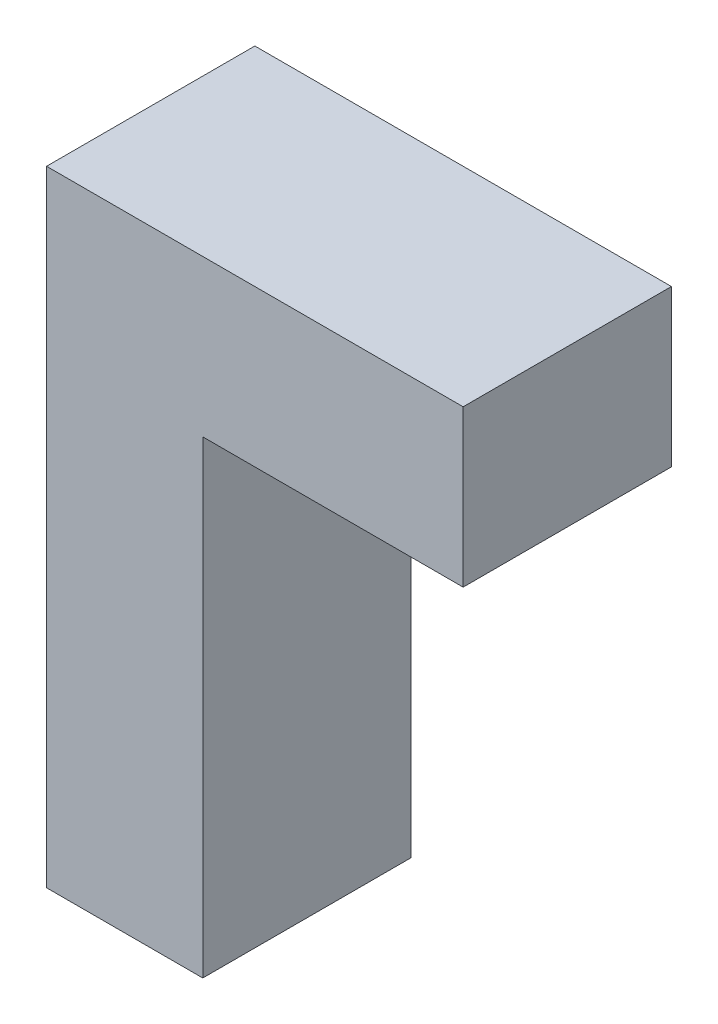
from build123d import *

# Parameters (mm, degrees)
EXTRUDE1_DEPTH = 25.4


with BuildPart() as part:
    # Sketch1 → Extrude1 (new body)
    with BuildSketch(Plane.XY):
        Polygon((0, 0), (19.05, 0), (19.05, 57.15), (50.8, 57.15), (50.8, 76.2), (0, 76.2), align=None)
    extrude(amount=EXTRUDE1_DEPTH)


solid = part.part
